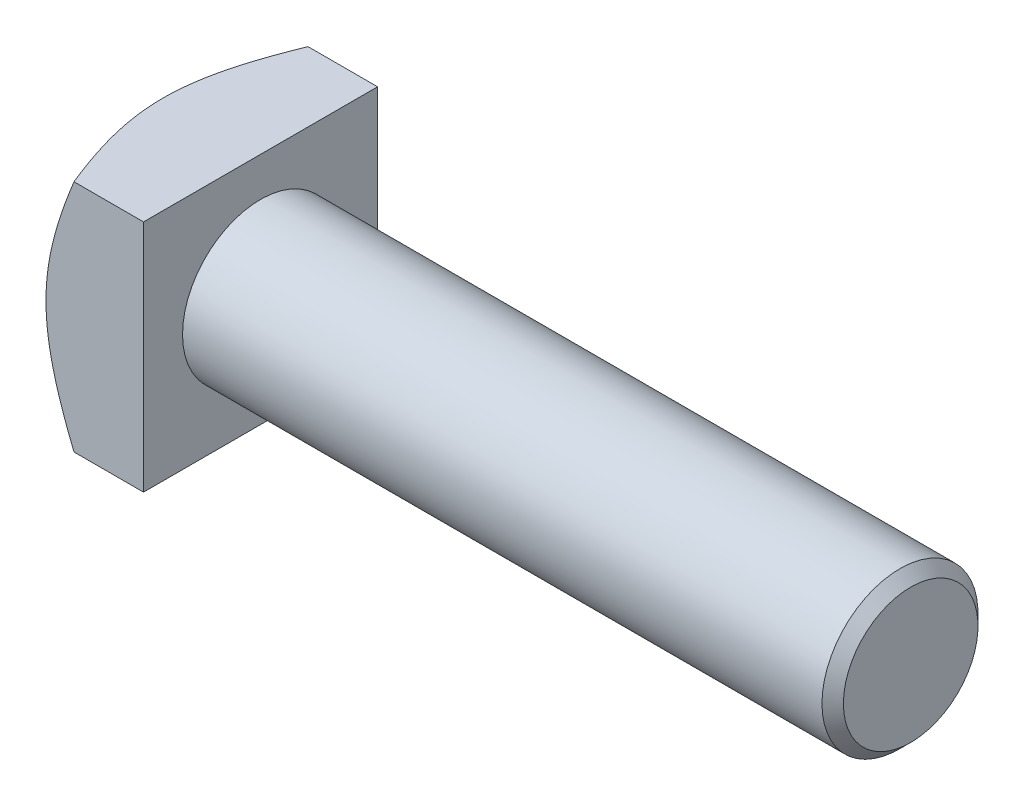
ISO-10303-21;
HEADER;
FILE_DESCRIPTION(('STEP AP214'),'2;1');
FILE_NAME('part.step','',(''),(''),'','','');
FILE_SCHEMA(('AUTOMOTIVE_DESIGN { 1 0 10303 214 1 1 1 1 }'));
ENDSEC;
DATA;
#1=APPLICATION_CONTEXT('core data for automotive mechanical design processes');
#2=APPLICATION_PROTOCOL_DEFINITION('international standard','automotive_design',2000,#1);
#3=PRODUCT_CONTEXT('',#1,'mechanical');
#4=PRODUCT('Part','Part','',(#3));
#5=PRODUCT_RELATED_PRODUCT_CATEGORY('part','',(#4));
#6=PRODUCT_DEFINITION_FORMATION('','',#4);
#7=PRODUCT_DEFINITION_CONTEXT('part definition',#1,'design');
#8=PRODUCT_DEFINITION('design','',#6,#7);
#9=PRODUCT_DEFINITION_SHAPE('','',#8);
#10=(LENGTH_UNIT() NAMED_UNIT(*) SI_UNIT(.MILLI.,.METRE.));
#11=(NAMED_UNIT(*) PLANE_ANGLE_UNIT() SI_UNIT($,.RADIAN.));
#12=(NAMED_UNIT(*) SI_UNIT($,.STERADIAN.) SOLID_ANGLE_UNIT());
#13=UNCERTAINTY_MEASURE_WITH_UNIT(LENGTH_MEASURE(1.E-05),#10,'distance_accuracy_value','');
#14=(GEOMETRIC_REPRESENTATION_CONTEXT(3) GLOBAL_UNCERTAINTY_ASSIGNED_CONTEXT((#13)) GLOBAL_UNIT_ASSIGNED_CONTEXT((#10,
#11,#12)) REPRESENTATION_CONTEXT('',''));
#15=CARTESIAN_POINT('',(0.,0.,0.));
#16=DIRECTION('',(0.,0.,1.));
#17=DIRECTION('',(1.,0.,0.));
#18=AXIS2_PLACEMENT_3D('',#15,#16,#17);
#19=CARTESIAN_POINT('',(15.,18.,18.));
#20=DIRECTION('',(0.,-1.,0.));
#21=DIRECTION('',(0.,0.,-1.));
#22=AXIS2_PLACEMENT_3D('',#19,#20,#21);
#23=PLANE('',#22);
#24=CARTESIAN_POINT('',(12.6143495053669,18.,-35.5516305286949));
#25=CARTESIAN_POINT('',(12.3897251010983,18.,-35.115539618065));
#26=CARTESIAN_POINT('',(12.1657628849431,18.,-34.6791077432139));
#27=CARTESIAN_POINT('',(11.7193055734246,18.,-33.8054922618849));
#28=CARTESIAN_POINT('',(11.4968104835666,18.,-33.3683086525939));
#29=CARTESIAN_POINT('',(10.8317168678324,18.,-32.0554797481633));
#30=CARTESIAN_POINT('',(10.3915360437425,18.,-31.1786068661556));
#31=CARTESIAN_POINT('',(9.51805366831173,18.,-29.418865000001));
#32=CARTESIAN_POINT('',(9.08477073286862,18.,-28.5359867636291));
#33=CARTESIAN_POINT('',(8.22808345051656,18.,-26.7654622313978));
#34=CARTESIAN_POINT('',(7.80467890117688,18.,-25.8778160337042));
#35=CARTESIAN_POINT('',(6.94713470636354,18.,-24.047257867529));
#36=CARTESIAN_POINT('',(6.51370370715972,18.,-23.1040131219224));
#37=CARTESIAN_POINT('',(5.66469197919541,18.,-21.2094066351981));
#38=CARTESIAN_POINT('',(5.24911226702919,18.,-20.2580444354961));
#39=CARTESIAN_POINT('',(4.64359961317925,18.,-18.8239444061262));
#40=CARTESIAN_POINT('',(4.44481871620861,18.,-18.3449395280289));
#41=CARTESIAN_POINT('',(4.05406467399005,18.,-17.3841648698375));
#42=CARTESIAN_POINT('',(3.86209139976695,18.,-16.9023951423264));
#43=CARTESIAN_POINT('',(3.48601609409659,18.,-15.9358345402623));
#44=CARTESIAN_POINT('',(3.3019133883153,18.,-15.4510439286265));
#45=CARTESIAN_POINT('',(2.942809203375,18.,-14.4781126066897));
#46=CARTESIAN_POINT('',(2.76780742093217,18.,-13.9899720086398));
#47=CARTESIAN_POINT('',(2.43022293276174,18.,-13.0154491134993));
#48=CARTESIAN_POINT('',(2.26752424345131,18.,-12.5291071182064));
#49=CARTESIAN_POINT('',(1.95406621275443,18.,-11.5526315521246));
#50=CARTESIAN_POINT('',(1.80330563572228,18.,-11.0624983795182));
#51=CARTESIAN_POINT('',(1.51554251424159,18.,-10.0782215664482));
#52=CARTESIAN_POINT('',(1.37853919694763,18.,-9.58407815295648));
#53=CARTESIAN_POINT('',(1.12025875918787,18.,-8.59148827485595));
#54=CARTESIAN_POINT('',(0.998987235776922,18.,-8.0930403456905));
#55=CARTESIAN_POINT('',(0.776567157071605,18.,-7.10179734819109));
#56=CARTESIAN_POINT('',(0.675074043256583,18.,-6.60908004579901));
#57=CARTESIAN_POINT('',(0.491413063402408,18.,-5.62006349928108));
#58=CARTESIAN_POINT('',(0.409243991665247,18.,-5.12376448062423));
#59=CARTESIAN_POINT('',(0.266179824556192,18.,-4.12821447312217));
#60=CARTESIAN_POINT('',(0.20527920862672,18.,-3.62896428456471));
#61=CARTESIAN_POINT('',(0.106341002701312,18.,-2.6282514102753));
#62=CARTESIAN_POINT('',(0.0683007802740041,18.,-2.12678898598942));
#63=CARTESIAN_POINT('',(0.0107702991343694,18.,-1.01808181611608));
#64=CARTESIAN_POINT('',(-0.00321223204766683,18.,-0.410540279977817));
#65=CARTESIAN_POINT('',(0.00445510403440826,18.,0.80424101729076));
#66=CARTESIAN_POINT('',(0.0261013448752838,18.,1.41148080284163));
#67=CARTESIAN_POINT('',(0.104069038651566,18.,2.62387258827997));
#68=CARTESIAN_POINT('',(0.160400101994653,18.,3.22902396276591));
#69=CARTESIAN_POINT('',(0.305431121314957,18.,4.43542103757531));
#70=CARTESIAN_POINT('',(0.394132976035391,18.,5.03666650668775));
#71=CARTESIAN_POINT('',(0.603510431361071,18.,6.25049011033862));
#72=CARTESIAN_POINT('',(0.724995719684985,18.,6.86292720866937));
#73=CARTESIAN_POINT('',(0.994802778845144,18.,8.08180978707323));
#74=CARTESIAN_POINT('',(1.14312501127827,18.,8.68825516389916));
#75=CARTESIAN_POINT('',(1.46277628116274,18.,9.89528627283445));
#76=CARTESIAN_POINT('',(1.63411490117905,18.,10.4958694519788));
#77=CARTESIAN_POINT('',(1.90565295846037,18.,11.3922751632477));
#78=CARTESIAN_POINT('',(1.99858593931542,18.,11.690328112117));
#79=CARTESIAN_POINT('',(2.18890137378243,18.,12.2850110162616));
#80=CARTESIAN_POINT('',(2.28628382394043,18.,12.5816409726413));
#81=CARTESIAN_POINT('',(2.57152114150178,18.,13.4307441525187));
#82=CARTESIAN_POINT('',(2.76444936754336,18.,13.9815162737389));
#83=CARTESIAN_POINT('',(3.16234165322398,18.,15.0787105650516));
#84=CARTESIAN_POINT('',(3.36730646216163,18.,15.6251324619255));
#85=CARTESIAN_POINT('',(3.78748333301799,18.,16.7141645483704));
#86=CARTESIAN_POINT('',(4.00269785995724,18.,17.2567737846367));
#87=CARTESIAN_POINT('',(4.4417893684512,18.,18.338455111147));
#88=CARTESIAN_POINT('',(4.66566618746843,18.,18.8775272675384));
#89=CARTESIAN_POINT('',(5.12102903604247,18.,19.9530541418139));
#90=CARTESIAN_POINT('',(5.35252218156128,18.,20.4895058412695));
#91=CARTESIAN_POINT('',(5.82184966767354,18.,21.5596261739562));
#92=CARTESIAN_POINT('',(6.05968403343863,18.,22.0932947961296));
#93=CARTESIAN_POINT('',(6.54077638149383,18.,23.1580998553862));
#94=CARTESIAN_POINT('',(6.78403369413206,18.,23.6892365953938));
#95=CARTESIAN_POINT('',(7.27526701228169,18.,24.749325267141));
#96=CARTESIAN_POINT('',(7.52324305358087,18.,25.2782771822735));
#97=CARTESIAN_POINT('',(8.27496653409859,18.,26.8657685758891));
#98=CARTESIAN_POINT('',(8.78489090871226,18.,27.9213844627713));
#99=CARTESIAN_POINT('',(9.81727493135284,18.,30.026473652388));
#100=CARTESIAN_POINT('',(10.3397348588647,18.,31.0759468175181));
#101=CARTESIAN_POINT('',(11.3941345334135,18.,33.1693891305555));
#102=CARTESIAN_POINT('',(11.9260689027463,18.,34.2133609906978));
#103=CARTESIAN_POINT('',(12.9976573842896,18.,36.2973185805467));
#104=CARTESIAN_POINT('',(13.537311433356,18.,37.3373043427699));
#105=CARTESIAN_POINT('',(14.5497453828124,18.,39.2742023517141));
#106=CARTESIAN_POINT('',(15.0217450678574,18.,40.1715228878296));
#107=CARTESIAN_POINT('',(15.9696412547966,18.,41.9641045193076));
#108=CARTESIAN_POINT('',(16.4455377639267,18.,42.8593656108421));
#109=CARTESIAN_POINT('',(17.4006926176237,18.,44.6482686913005));
#110=CARTESIAN_POINT('',(17.8799514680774,18.,45.5419104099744));
#111=CARTESIAN_POINT('',(18.8412702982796,18.,47.3276860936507));
#112=CARTESIAN_POINT('',(19.3233302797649,18.,48.2198200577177));
#113=CARTESIAN_POINT('',(20.2865567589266,18.,49.9967045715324));
#114=CARTESIAN_POINT('',(20.767706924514,18.,50.8814639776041));
#115=CARTESIAN_POINT('',(21.7320575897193,18.,52.6498648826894));
#116=CARTESIAN_POINT('',(22.2152580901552,18.,53.5335063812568));
#117=CARTESIAN_POINT('',(23.1833545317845,18.,55.2996537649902));
#118=CARTESIAN_POINT('',(23.6682501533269,18.,56.1821598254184));
#119=CARTESIAN_POINT('',(24.6396074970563,18.,57.9463078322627));
#120=CARTESIAN_POINT('',(25.126069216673,18.,58.8279497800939));
#121=CARTESIAN_POINT('',(25.6132070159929,18.,59.7092174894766));
#122=B_SPLINE_CURVE_WITH_KNOTS('',3,(#24,#25,#26,#27,#28,#29,#30,#31,#32,#33,#34,#35,#36,#37,
#38,#39,#40,#41,#42,#43,#44,#45,#46,#47,#48,#49,#50,#51,#52,#53,#54,#55,#56,#57,#58,#59,#60,#61,
#62,#63,#64,#65,#66,#67,#68,#69,#70,#71,#72,#73,#74,#75,#76,#77,#78,#79,#80,#81,#82,#83,#84,#85,
#86,#87,#88,#89,#90,#91,#92,#93,#94,#95,#96,#97,#98,#99,#100,#101,#102,#103,#104,#105,#106,#107,
#108,#109,#110,#111,#112,#113,#114,#115,#116,#117,#118,#119,#120,#121),.UNSPECIFIED.,.F.,.F.,(4,
2,2,2,2,2,2,2,2,2,2,2,2,2,2,2,2,2,2,2,2,2,2,2,2,2,2,2,2,2,2,2,2,2,2,2,2,2,2,2,2,2,2,2,2,2,2,2,
4),(0.,1.47162477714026,2.94325507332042,5.8866861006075,8.83704034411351,11.7873340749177,
14.9013896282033,18.0156222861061,19.5714198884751,21.1271879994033,22.6828225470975,
24.2384052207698,25.7767766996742,27.3149887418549,28.8531143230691,30.3917856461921,
31.9006252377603,33.4093706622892,34.9177241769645,36.425903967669,38.247941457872,
40.0697935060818,41.8921505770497,43.7146145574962,45.5870275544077,47.4594727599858,
49.3326999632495,50.2692875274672,51.2058743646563,52.9564472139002,54.7071291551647,
56.4582342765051,58.2093065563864,59.9620641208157,61.714828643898,63.4673779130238,
65.2199404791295,68.7367939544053,72.2537259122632,75.7687215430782,79.2836884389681,
82.3253401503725,85.3669975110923,88.4091227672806,91.4512499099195,94.4726276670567,
97.4940066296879,100.514843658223,103.535675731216),.UNSPECIFIED.);
#123=CARTESIAN_POINT('',(4.30463361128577,18.,18.));
#124=VERTEX_POINT('',#123);
#125=CARTESIAN_POINT('',(0.,18.,0.));
#126=VERTEX_POINT('',#125);
#127=EDGE_CURVE('E88',#124,#126,#122,.F.);
#128=ORIENTED_EDGE('',*,*,#127,.F.);
#129=DIRECTION('',(-1.,0.,0.));
#130=VECTOR('',#129,1.);
#131=CARTESIAN_POINT('',(15.,18.,18.));
#132=LINE('',#131,#130);
#133=CARTESIAN_POINT('',(15.,18.,18.));
#134=VERTEX_POINT('',#133);
#135=EDGE_CURVE('E174',#134,#124,#132,.T.);
#136=ORIENTED_EDGE('',*,*,#135,.F.);
#137=DIRECTION('',(0.,0.,1.));
#138=VECTOR('',#137,1.);
#139=CARTESIAN_POINT('',(15.,18.,18.));
#140=LINE('',#139,#138);
#141=CARTESIAN_POINT('',(15.,18.,-18.));
#142=VERTEX_POINT('',#141);
#143=EDGE_CURVE('E187',#142,#134,#140,.T.);
#144=ORIENTED_EDGE('',*,*,#143,.F.);
#145=DIRECTION('',(-1.,0.,0.));
#146=VECTOR('',#145,1.);
#147=CARTESIAN_POINT('',(15.,18.,-18.));
#148=LINE('',#147,#146);
#149=CARTESIAN_POINT('',(4.30463361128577,18.,-18.));
#150=VERTEX_POINT('',#149);
#151=EDGE_CURVE('E113',#142,#150,#148,.T.);
#152=ORIENTED_EDGE('',*,*,#151,.T.);
#153=EDGE_CURVE('E97',#126,#150,#122,.F.);
#154=ORIENTED_EDGE('',*,*,#153,.F.);
#155=EDGE_LOOP('',(#128,#136,#144,#152,#154));
#156=FACE_BOUND('',#155,.T.);
#157=ADVANCED_FACE('F37',(#156),#23,.F.);
#158=CARTESIAN_POINT('',(15.,18.,18.));
#159=DIRECTION('',(0.,0.,-1.));
#160=DIRECTION('',(0.,1.,0.));
#161=AXIS2_PLACEMENT_3D('',#158,#159,#160);
#162=PLANE('',#161);
#163=CARTESIAN_POINT('',(12.6143495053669,-35.5516305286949,18.));
#164=CARTESIAN_POINT('',(12.3897251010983,-35.115539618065,18.));
#165=CARTESIAN_POINT('',(12.1657628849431,-34.6791077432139,18.));
#166=CARTESIAN_POINT('',(11.7193055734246,-33.8054922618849,18.));
#167=CARTESIAN_POINT('',(11.4968104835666,-33.3683086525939,18.));
#168=CARTESIAN_POINT('',(10.8317168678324,-32.0554797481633,18.));
#169=CARTESIAN_POINT('',(10.3915360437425,-31.1786068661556,18.));
#170=CARTESIAN_POINT('',(9.51805366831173,-29.4188650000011,18.));
#171=CARTESIAN_POINT('',(9.08477073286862,-28.5359867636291,18.));
#172=CARTESIAN_POINT('',(8.22808345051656,-26.7654622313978,18.));
#173=CARTESIAN_POINT('',(7.80467890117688,-25.8778160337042,18.));
#174=CARTESIAN_POINT('',(6.94713470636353,-24.047257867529,18.));
#175=CARTESIAN_POINT('',(6.51370370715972,-23.1040131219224,18.));
#176=CARTESIAN_POINT('',(5.66469197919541,-21.2094066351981,18.));
#177=CARTESIAN_POINT('',(5.24911226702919,-20.2580444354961,18.));
#178=CARTESIAN_POINT('',(4.64359961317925,-18.8239444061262,18.));
#179=CARTESIAN_POINT('',(4.44481871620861,-18.3449395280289,18.));
#180=CARTESIAN_POINT('',(4.05406467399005,-17.3841648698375,18.));
#181=CARTESIAN_POINT('',(3.86209139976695,-16.9023951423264,18.));
#182=CARTESIAN_POINT('',(3.48601609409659,-15.9358345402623,18.));
#183=CARTESIAN_POINT('',(3.3019133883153,-15.4510439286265,18.));
#184=CARTESIAN_POINT('',(2.942809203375,-14.4781126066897,18.));
#185=CARTESIAN_POINT('',(2.76780742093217,-13.9899720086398,18.));
#186=CARTESIAN_POINT('',(2.43022293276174,-13.0154491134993,18.));
#187=CARTESIAN_POINT('',(2.26752424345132,-12.5291071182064,18.));
#188=CARTESIAN_POINT('',(1.95406621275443,-11.5526315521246,18.));
#189=CARTESIAN_POINT('',(1.80330563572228,-11.0624983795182,18.));
#190=CARTESIAN_POINT('',(1.51554251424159,-10.0782215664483,18.));
#191=CARTESIAN_POINT('',(1.37853919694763,-9.58407815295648,18.));
#192=CARTESIAN_POINT('',(1.12025875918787,-8.59148827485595,18.));
#193=CARTESIAN_POINT('',(0.998987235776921,-8.0930403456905,18.));
#194=CARTESIAN_POINT('',(0.776567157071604,-7.10179734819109,18.));
#195=CARTESIAN_POINT('',(0.675074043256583,-6.60908004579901,18.));
#196=CARTESIAN_POINT('',(0.491413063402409,-5.62006349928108,18.));
#197=CARTESIAN_POINT('',(0.409243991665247,-5.12376448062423,18.));
#198=CARTESIAN_POINT('',(0.266179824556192,-4.12821447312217,18.));
#199=CARTESIAN_POINT('',(0.20527920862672,-3.62896428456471,18.));
#200=CARTESIAN_POINT('',(0.106341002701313,-2.6282514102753,18.));
#201=CARTESIAN_POINT('',(0.068300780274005,-2.12678898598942,18.));
#202=CARTESIAN_POINT('',(0.0107702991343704,-1.01808181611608,18.));
#203=CARTESIAN_POINT('',(-0.00321223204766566,-0.410540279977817,18.));
#204=CARTESIAN_POINT('',(0.00445510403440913,0.804241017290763,18.));
#205=CARTESIAN_POINT('',(0.0261013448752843,1.41148080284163,18.));
#206=CARTESIAN_POINT('',(0.104069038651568,2.62387258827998,18.));
#207=CARTESIAN_POINT('',(0.160400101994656,3.22902396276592,18.));
#208=CARTESIAN_POINT('',(0.30543112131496,4.43542103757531,18.));
#209=CARTESIAN_POINT('',(0.394132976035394,5.03666650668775,18.));
#210=CARTESIAN_POINT('',(0.603510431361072,6.25049011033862,18.));
#211=CARTESIAN_POINT('',(0.724995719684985,6.86292720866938,18.));
#212=CARTESIAN_POINT('',(0.994802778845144,8.08180978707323,18.));
#213=CARTESIAN_POINT('',(1.14312501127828,8.68825516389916,18.));
#214=CARTESIAN_POINT('',(1.46277628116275,9.89528627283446,18.));
#215=CARTESIAN_POINT('',(1.63411490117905,10.4958694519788,18.));
#216=CARTESIAN_POINT('',(1.90565295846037,11.3922751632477,18.));
#217=CARTESIAN_POINT('',(1.99858593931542,11.690328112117,18.));
#218=CARTESIAN_POINT('',(2.18890137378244,12.2850110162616,18.));
#219=CARTESIAN_POINT('',(2.28628382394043,12.5816409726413,18.));
#220=CARTESIAN_POINT('',(2.57152114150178,13.4307441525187,18.));
#221=CARTESIAN_POINT('',(2.76444936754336,13.9815162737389,18.));
#222=CARTESIAN_POINT('',(3.16234165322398,15.0787105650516,18.));
#223=CARTESIAN_POINT('',(3.36730646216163,15.6251324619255,18.));
#224=CARTESIAN_POINT('',(3.78748333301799,16.7141645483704,18.));
#225=CARTESIAN_POINT('',(4.00269785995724,17.2567737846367,18.));
#226=CARTESIAN_POINT('',(4.4417893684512,18.338455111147,18.));
#227=CARTESIAN_POINT('',(4.66566618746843,18.8775272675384,18.));
#228=CARTESIAN_POINT('',(5.12102903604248,19.9530541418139,18.));
#229=CARTESIAN_POINT('',(5.35252218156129,20.4895058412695,18.));
#230=CARTESIAN_POINT('',(5.82184966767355,21.5596261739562,18.));
#231=CARTESIAN_POINT('',(6.05968403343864,22.0932947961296,18.));
#232=CARTESIAN_POINT('',(6.54077638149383,23.1580998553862,18.));
#233=CARTESIAN_POINT('',(6.78403369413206,23.6892365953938,18.));
#234=CARTESIAN_POINT('',(7.2752670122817,24.749325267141,18.));
#235=CARTESIAN_POINT('',(7.52324305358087,25.2782771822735,18.));
#236=CARTESIAN_POINT('',(8.2749665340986,26.8657685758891,18.));
#237=CARTESIAN_POINT('',(8.78489090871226,27.9213844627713,18.));
#238=CARTESIAN_POINT('',(9.81727493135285,30.026473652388,18.));
#239=CARTESIAN_POINT('',(10.3397348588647,31.0759468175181,18.));
#240=CARTESIAN_POINT('',(11.3941345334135,33.1693891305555,18.));
#241=CARTESIAN_POINT('',(11.9260689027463,34.2133609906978,18.));
#242=CARTESIAN_POINT('',(12.9976573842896,36.2973185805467,18.));
#243=CARTESIAN_POINT('',(13.537311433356,37.3373043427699,18.));
#244=CARTESIAN_POINT('',(14.5497453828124,39.2742023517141,18.));
#245=CARTESIAN_POINT('',(15.0217450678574,40.1715228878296,18.));
#246=CARTESIAN_POINT('',(15.9696412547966,41.9641045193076,18.));
#247=CARTESIAN_POINT('',(16.4455377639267,42.8593656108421,18.));
#248=CARTESIAN_POINT('',(17.4006926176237,44.6482686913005,18.));
#249=CARTESIAN_POINT('',(17.8799514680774,45.5419104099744,18.));
#250=CARTESIAN_POINT('',(18.8412702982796,47.3276860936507,18.));
#251=CARTESIAN_POINT('',(19.3233302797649,48.2198200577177,18.));
#252=CARTESIAN_POINT('',(20.2865567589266,49.9967045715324,18.));
#253=CARTESIAN_POINT('',(20.767706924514,50.8814639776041,18.));
#254=CARTESIAN_POINT('',(21.7320575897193,52.6498648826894,18.));
#255=CARTESIAN_POINT('',(22.2152580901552,53.5335063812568,18.));
#256=CARTESIAN_POINT('',(23.1833545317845,55.2996537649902,18.));
#257=CARTESIAN_POINT('',(23.6682501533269,56.1821598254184,18.));
#258=CARTESIAN_POINT('',(24.6396074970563,57.9463078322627,18.));
#259=CARTESIAN_POINT('',(25.126069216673,58.8279497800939,18.));
#260=CARTESIAN_POINT('',(25.6132070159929,59.7092174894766,18.));
#261=B_SPLINE_CURVE_WITH_KNOTS('',3,(#163,#164,#165,#166,#167,#168,#169,#170,#171,#172,#173,
#174,#175,#176,#177,#178,#179,#180,#181,#182,#183,#184,#185,#186,#187,#188,#189,#190,#191,#192,
#193,#194,#195,#196,#197,#198,#199,#200,#201,#202,#203,#204,#205,#206,#207,#208,#209,#210,#211,
#212,#213,#214,#215,#216,#217,#218,#219,#220,#221,#222,#223,#224,#225,#226,#227,#228,#229,#230,
#231,#232,#233,#234,#235,#236,#237,#238,#239,#240,#241,#242,#243,#244,#245,#246,#247,#248,#249,
#250,#251,#252,#253,#254,#255,#256,#257,#258,#259,#260),.UNSPECIFIED.,.F.,.F.,(4,2,2,2,2,2,2,2,
2,2,2,2,2,2,2,2,2,2,2,2,2,2,2,2,2,2,2,2,2,2,2,2,2,2,2,2,2,2,2,2,2,2,2,2,2,2,2,2,4),(0.,
1.47162477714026,2.94325507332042,5.8866861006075,8.8370403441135,11.7873340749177,
14.9013896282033,18.0156222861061,19.5714198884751,21.1271879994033,22.6828225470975,
24.2384052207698,25.7767766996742,27.3149887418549,28.8531143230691,30.3917856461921,
31.9006252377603,33.4093706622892,34.9177241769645,36.425903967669,38.247941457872,
40.0697935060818,41.8921505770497,43.7146145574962,45.5870275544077,47.4594727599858,
49.3326999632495,50.2692875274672,51.2058743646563,52.9564472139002,54.7071291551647,
56.4582342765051,58.2093065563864,59.9620641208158,61.714828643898,63.4673779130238,
65.2199404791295,68.7367939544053,72.2537259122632,75.7687215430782,79.2836884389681,
82.3253401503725,85.3669975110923,88.4091227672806,91.4512499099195,94.4726276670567,
97.4940066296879,100.514843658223,103.535675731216),.UNSPECIFIED.);
#262=CARTESIAN_POINT('',(4.30463361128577,-18.,18.));
#263=VERTEX_POINT('',#262);
#264=CARTESIAN_POINT('',(0.,0.,18.));
#265=VERTEX_POINT('',#264);
#266=EDGE_CURVE('E165',#263,#265,#261,.T.);
#267=ORIENTED_EDGE('',*,*,#266,.F.);
#268=DIRECTION('',(-1.,0.,0.));
#269=VECTOR('',#268,1.);
#270=CARTESIAN_POINT('',(15.,-18.,18.));
#271=LINE('',#270,#269);
#272=CARTESIAN_POINT('',(15.,-18.,18.));
#273=VERTEX_POINT('',#272);
#274=EDGE_CURVE('E167',#273,#263,#271,.T.);
#275=ORIENTED_EDGE('',*,*,#274,.F.);
#276=DIRECTION('',(0.,-1.,0.));
#277=VECTOR('',#276,1.);
#278=CARTESIAN_POINT('',(15.,18.,18.));
#279=LINE('',#278,#277);
#280=EDGE_CURVE('E185',#134,#273,#279,.T.);
#281=ORIENTED_EDGE('',*,*,#280,.F.);
#282=ORIENTED_EDGE('',*,*,#135,.T.);
#283=EDGE_CURVE('E91',#265,#124,#261,.T.);
#284=ORIENTED_EDGE('',*,*,#283,.F.);
#285=EDGE_LOOP('',(#267,#275,#281,#282,#284));
#286=FACE_BOUND('',#285,.T.);
#287=ADVANCED_FACE('F155',(#286),#162,.F.);
#288=CARTESIAN_POINT('',(15.,-18.,18.));
#289=DIRECTION('',(0.,1.,0.));
#290=DIRECTION('',(0.,0.,1.));
#291=AXIS2_PLACEMENT_3D('',#288,#289,#290);
#292=PLANE('',#291);
#293=CARTESIAN_POINT('',(12.6143495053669,-18.,-35.5516305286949));
#294=CARTESIAN_POINT('',(12.3897251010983,-18.,-35.115539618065));
#295=CARTESIAN_POINT('',(12.1657628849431,-18.,-34.6791077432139));
#296=CARTESIAN_POINT('',(11.7193055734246,-18.,-33.8054922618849));
#297=CARTESIAN_POINT('',(11.4968104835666,-18.,-33.3683086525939));
#298=CARTESIAN_POINT('',(10.8317168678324,-18.,-32.0554797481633));
#299=CARTESIAN_POINT('',(10.3915360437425,-18.,-31.1786068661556));
#300=CARTESIAN_POINT('',(9.51805366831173,-18.,-29.418865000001));
#301=CARTESIAN_POINT('',(9.08477073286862,-18.,-28.5359867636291));
#302=CARTESIAN_POINT('',(8.22808345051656,-18.,-26.7654622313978));
#303=CARTESIAN_POINT('',(7.80467890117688,-18.,-25.8778160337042));
#304=CARTESIAN_POINT('',(6.94713470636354,-18.,-24.047257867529));
#305=CARTESIAN_POINT('',(6.51370370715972,-18.,-23.1040131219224));
#306=CARTESIAN_POINT('',(5.66469197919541,-18.,-21.2094066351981));
#307=CARTESIAN_POINT('',(5.24911226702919,-18.,-20.2580444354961));
#308=CARTESIAN_POINT('',(4.64359961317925,-18.,-18.8239444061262));
#309=CARTESIAN_POINT('',(4.44481871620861,-18.,-18.3449395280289));
#310=CARTESIAN_POINT('',(4.05406467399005,-18.,-17.3841648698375));
#311=CARTESIAN_POINT('',(3.86209139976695,-18.,-16.9023951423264));
#312=CARTESIAN_POINT('',(3.48601609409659,-18.,-15.9358345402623));
#313=CARTESIAN_POINT('',(3.3019133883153,-18.,-15.4510439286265));
#314=CARTESIAN_POINT('',(2.942809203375,-18.,-14.4781126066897));
#315=CARTESIAN_POINT('',(2.76780742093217,-18.,-13.9899720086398));
#316=CARTESIAN_POINT('',(2.43022293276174,-18.,-13.0154491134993));
#317=CARTESIAN_POINT('',(2.26752424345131,-18.,-12.5291071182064));
#318=CARTESIAN_POINT('',(1.95406621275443,-18.,-11.5526315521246));
#319=CARTESIAN_POINT('',(1.80330563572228,-18.,-11.0624983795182));
#320=CARTESIAN_POINT('',(1.51554251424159,-18.,-10.0782215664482));
#321=CARTESIAN_POINT('',(1.37853919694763,-18.,-9.58407815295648));
#322=CARTESIAN_POINT('',(1.12025875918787,-18.,-8.59148827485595));
#323=CARTESIAN_POINT('',(0.998987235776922,-18.,-8.0930403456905));
#324=CARTESIAN_POINT('',(0.776567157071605,-18.,-7.10179734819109));
#325=CARTESIAN_POINT('',(0.675074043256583,-18.,-6.60908004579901));
#326=CARTESIAN_POINT('',(0.491413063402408,-18.,-5.62006349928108));
#327=CARTESIAN_POINT('',(0.409243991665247,-18.,-5.12376448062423));
#328=CARTESIAN_POINT('',(0.266179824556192,-18.,-4.12821447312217));
#329=CARTESIAN_POINT('',(0.20527920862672,-18.,-3.62896428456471));
#330=CARTESIAN_POINT('',(0.106341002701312,-18.,-2.6282514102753));
#331=CARTESIAN_POINT('',(0.0683007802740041,-18.,-2.12678898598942));
#332=CARTESIAN_POINT('',(0.0107702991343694,-18.,-1.01808181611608));
#333=CARTESIAN_POINT('',(-0.00321223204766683,-18.,-0.410540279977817));
#334=CARTESIAN_POINT('',(0.00445510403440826,-18.,0.80424101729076));
#335=CARTESIAN_POINT('',(0.0261013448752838,-18.,1.41148080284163));
#336=CARTESIAN_POINT('',(0.104069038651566,-18.,2.62387258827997));
#337=CARTESIAN_POINT('',(0.160400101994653,-18.,3.22902396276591));
#338=CARTESIAN_POINT('',(0.305431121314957,-18.,4.43542103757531));
#339=CARTESIAN_POINT('',(0.394132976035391,-18.,5.03666650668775));
#340=CARTESIAN_POINT('',(0.603510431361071,-18.,6.25049011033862));
#341=CARTESIAN_POINT('',(0.724995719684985,-18.,6.86292720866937));
#342=CARTESIAN_POINT('',(0.994802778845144,-18.,8.08180978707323));
#343=CARTESIAN_POINT('',(1.14312501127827,-18.,8.68825516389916));
#344=CARTESIAN_POINT('',(1.46277628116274,-18.,9.89528627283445));
#345=CARTESIAN_POINT('',(1.63411490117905,-18.,10.4958694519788));
#346=CARTESIAN_POINT('',(1.90565295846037,-18.,11.3922751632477));
#347=CARTESIAN_POINT('',(1.99858593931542,-18.,11.690328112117));
#348=CARTESIAN_POINT('',(2.18890137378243,-18.,12.2850110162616));
#349=CARTESIAN_POINT('',(2.28628382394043,-18.,12.5816409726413));
#350=CARTESIAN_POINT('',(2.57152114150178,-18.,13.4307441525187));
#351=CARTESIAN_POINT('',(2.76444936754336,-18.,13.9815162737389));
#352=CARTESIAN_POINT('',(3.16234165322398,-18.,15.0787105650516));
#353=CARTESIAN_POINT('',(3.36730646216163,-18.,15.6251324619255));
#354=CARTESIAN_POINT('',(3.78748333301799,-18.,16.7141645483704));
#355=CARTESIAN_POINT('',(4.00269785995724,-18.,17.2567737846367));
#356=CARTESIAN_POINT('',(4.4417893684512,-18.,18.338455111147));
#357=CARTESIAN_POINT('',(4.66566618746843,-18.,18.8775272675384));
#358=CARTESIAN_POINT('',(5.12102903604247,-18.,19.9530541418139));
#359=CARTESIAN_POINT('',(5.35252218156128,-18.,20.4895058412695));
#360=CARTESIAN_POINT('',(5.82184966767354,-18.,21.5596261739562));
#361=CARTESIAN_POINT('',(6.05968403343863,-18.,22.0932947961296));
#362=CARTESIAN_POINT('',(6.54077638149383,-18.,23.1580998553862));
#363=CARTESIAN_POINT('',(6.78403369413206,-18.,23.6892365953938));
#364=CARTESIAN_POINT('',(7.27526701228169,-18.,24.749325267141));
#365=CARTESIAN_POINT('',(7.52324305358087,-18.,25.2782771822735));
#366=CARTESIAN_POINT('',(8.27496653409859,-18.,26.8657685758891));
#367=CARTESIAN_POINT('',(8.78489090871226,-18.,27.9213844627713));
#368=CARTESIAN_POINT('',(9.81727493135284,-18.,30.026473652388));
#369=CARTESIAN_POINT('',(10.3397348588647,-18.,31.0759468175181));
#370=CARTESIAN_POINT('',(11.3941345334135,-18.,33.1693891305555));
#371=CARTESIAN_POINT('',(11.9260689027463,-18.,34.2133609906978));
#372=CARTESIAN_POINT('',(12.9976573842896,-18.,36.2973185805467));
#373=CARTESIAN_POINT('',(13.537311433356,-18.,37.3373043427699));
#374=CARTESIAN_POINT('',(14.5497453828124,-18.,39.2742023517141));
#375=CARTESIAN_POINT('',(15.0217450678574,-18.,40.1715228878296));
#376=CARTESIAN_POINT('',(15.9696412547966,-18.,41.9641045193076));
#377=CARTESIAN_POINT('',(16.4455377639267,-18.,42.8593656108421));
#378=CARTESIAN_POINT('',(17.4006926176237,-18.,44.6482686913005));
#379=CARTESIAN_POINT('',(17.8799514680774,-18.,45.5419104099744));
#380=CARTESIAN_POINT('',(18.8412702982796,-18.,47.3276860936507));
#381=CARTESIAN_POINT('',(19.3233302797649,-18.,48.2198200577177));
#382=CARTESIAN_POINT('',(20.2865567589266,-18.,49.9967045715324));
#383=CARTESIAN_POINT('',(20.767706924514,-18.,50.8814639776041));
#384=CARTESIAN_POINT('',(21.7320575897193,-18.,52.6498648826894));
#385=CARTESIAN_POINT('',(22.2152580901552,-18.,53.5335063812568));
#386=CARTESIAN_POINT('',(23.1833545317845,-18.,55.2996537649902));
#387=CARTESIAN_POINT('',(23.6682501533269,-18.,56.1821598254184));
#388=CARTESIAN_POINT('',(24.6396074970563,-18.,57.9463078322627));
#389=CARTESIAN_POINT('',(25.126069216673,-18.,58.8279497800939));
#390=CARTESIAN_POINT('',(25.6132070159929,-18.,59.7092174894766));
#391=B_SPLINE_CURVE_WITH_KNOTS('',3,(#293,#294,#295,#296,#297,#298,#299,#300,#301,#302,#303,
#304,#305,#306,#307,#308,#309,#310,#311,#312,#313,#314,#315,#316,#317,#318,#319,#320,#321,#322,
#323,#324,#325,#326,#327,#328,#329,#330,#331,#332,#333,#334,#335,#336,#337,#338,#339,#340,#341,
#342,#343,#344,#345,#346,#347,#348,#349,#350,#351,#352,#353,#354,#355,#356,#357,#358,#359,#360,
#361,#362,#363,#364,#365,#366,#367,#368,#369,#370,#371,#372,#373,#374,#375,#376,#377,#378,#379,
#380,#381,#382,#383,#384,#385,#386,#387,#388,#389,#390),.UNSPECIFIED.,.F.,.F.,(4,2,2,2,2,2,2,2,
2,2,2,2,2,2,2,2,2,2,2,2,2,2,2,2,2,2,2,2,2,2,2,2,2,2,2,2,2,2,2,2,2,2,2,2,2,2,2,2,4),(0.,
1.47162477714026,2.94325507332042,5.8866861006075,8.83704034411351,11.7873340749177,
14.9013896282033,18.0156222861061,19.5714198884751,21.1271879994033,22.6828225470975,
24.2384052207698,25.7767766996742,27.3149887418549,28.8531143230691,30.3917856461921,
31.9006252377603,33.4093706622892,34.9177241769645,36.425903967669,38.247941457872,
40.0697935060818,41.8921505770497,43.7146145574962,45.5870275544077,47.4594727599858,
49.3326999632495,50.2692875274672,51.2058743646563,52.9564472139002,54.7071291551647,
56.4582342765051,58.2093065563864,59.9620641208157,61.714828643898,63.4673779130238,
65.2199404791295,68.7367939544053,72.2537259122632,75.7687215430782,79.2836884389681,
82.3253401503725,85.3669975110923,88.4091227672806,91.4512499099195,94.4726276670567,
97.4940066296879,100.514843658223,103.535675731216),.UNSPECIFIED.);
#392=CARTESIAN_POINT('',(4.30463361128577,-18.,-18.));
#393=VERTEX_POINT('',#392);
#394=CARTESIAN_POINT('',(0.,-18.,0.));
#395=VERTEX_POINT('',#394);
#396=EDGE_CURVE('E114',#393,#395,#391,.T.);
#397=ORIENTED_EDGE('',*,*,#396,.F.);
#398=DIRECTION('',(-1.,0.,0.));
#399=VECTOR('',#398,1.);
#400=CARTESIAN_POINT('',(15.,-18.,-18.));
#401=LINE('',#400,#399);
#402=CARTESIAN_POINT('',(15.,-18.,-18.));
#403=VERTEX_POINT('',#402);
#404=EDGE_CURVE('E175',#403,#393,#401,.T.);
#405=ORIENTED_EDGE('',*,*,#404,.F.);
#406=DIRECTION('',(0.,0.,-1.));
#407=VECTOR('',#406,1.);
#408=CARTESIAN_POINT('',(15.,-18.,18.));
#409=LINE('',#408,#407);
#410=EDGE_CURVE('E173',#273,#403,#409,.T.);
#411=ORIENTED_EDGE('',*,*,#410,.F.);
#412=ORIENTED_EDGE('',*,*,#274,.T.);
#413=EDGE_CURVE('E96',#395,#263,#391,.T.);
#414=ORIENTED_EDGE('',*,*,#413,.F.);
#415=EDGE_LOOP('',(#397,#405,#411,#412,#414));
#416=FACE_BOUND('',#415,.T.);
#417=ADVANCED_FACE('F150',(#416),#292,.F.);
#418=CARTESIAN_POINT('',(15.,18.,-18.));
#419=DIRECTION('',(0.,0.,1.));
#420=DIRECTION('',(1.,0.,0.));
#421=AXIS2_PLACEMENT_3D('',#418,#419,#420);
#422=PLANE('',#421);
#423=CARTESIAN_POINT('',(12.6143495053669,-35.5516305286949,-18.));
#424=CARTESIAN_POINT('',(12.3897251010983,-35.115539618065,-18.));
#425=CARTESIAN_POINT('',(12.1657628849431,-34.6791077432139,-18.));
#426=CARTESIAN_POINT('',(11.7193055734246,-33.8054922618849,-18.));
#427=CARTESIAN_POINT('',(11.4968104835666,-33.3683086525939,-18.));
#428=CARTESIAN_POINT('',(10.8317168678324,-32.0554797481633,-18.));
#429=CARTESIAN_POINT('',(10.3915360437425,-31.1786068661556,-18.));
#430=CARTESIAN_POINT('',(9.51805366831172,-29.418865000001,-18.));
#431=CARTESIAN_POINT('',(9.08477073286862,-28.5359867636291,-18.));
#432=CARTESIAN_POINT('',(8.22808345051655,-26.7654622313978,-18.));
#433=CARTESIAN_POINT('',(7.80467890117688,-25.8778160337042,-18.));
#434=CARTESIAN_POINT('',(6.94713470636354,-24.047257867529,-18.));
#435=CARTESIAN_POINT('',(6.51370370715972,-23.1040131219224,-18.));
#436=CARTESIAN_POINT('',(5.66469197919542,-21.2094066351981,-18.));
#437=CARTESIAN_POINT('',(5.24911226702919,-20.2580444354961,-18.));
#438=CARTESIAN_POINT('',(4.64359961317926,-18.8239444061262,-18.));
#439=CARTESIAN_POINT('',(4.44481871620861,-18.3449395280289,-18.));
#440=CARTESIAN_POINT('',(4.05406467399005,-17.3841648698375,-18.));
#441=CARTESIAN_POINT('',(3.86209139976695,-16.9023951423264,-18.));
#442=CARTESIAN_POINT('',(3.4860160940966,-15.9358345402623,-18.));
#443=CARTESIAN_POINT('',(3.30191338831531,-15.4510439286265,-18.));
#444=CARTESIAN_POINT('',(2.942809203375,-14.4781126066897,-18.));
#445=CARTESIAN_POINT('',(2.76780742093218,-13.9899720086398,-18.));
#446=CARTESIAN_POINT('',(2.43022293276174,-13.0154491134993,-18.));
#447=CARTESIAN_POINT('',(2.26752424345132,-12.5291071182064,-18.));
#448=CARTESIAN_POINT('',(1.95406621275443,-11.5526315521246,-18.));
#449=CARTESIAN_POINT('',(1.80330563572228,-11.0624983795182,-18.));
#450=CARTESIAN_POINT('',(1.51554251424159,-10.0782215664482,-18.));
#451=CARTESIAN_POINT('',(1.37853919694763,-9.58407815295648,-18.));
#452=CARTESIAN_POINT('',(1.12025875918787,-8.59148827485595,-18.));
#453=CARTESIAN_POINT('',(0.99898723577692,-8.0930403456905,-18.));
#454=CARTESIAN_POINT('',(0.776567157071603,-7.10179734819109,-18.));
#455=CARTESIAN_POINT('',(0.67507404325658,-6.60908004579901,-18.));
#456=CARTESIAN_POINT('',(0.491413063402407,-5.62006349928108,-18.));
#457=CARTESIAN_POINT('',(0.409243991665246,-5.12376448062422,-18.));
#458=CARTESIAN_POINT('',(0.266179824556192,-4.12821447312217,-18.));
#459=CARTESIAN_POINT('',(0.20527920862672,-3.62896428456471,-18.));
#460=CARTESIAN_POINT('',(0.106341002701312,-2.6282514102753,-18.));
#461=CARTESIAN_POINT('',(0.0683007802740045,-2.12678898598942,-18.));
#462=CARTESIAN_POINT('',(0.0107702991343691,-1.01808181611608,-18.));
#463=CARTESIAN_POINT('',(-0.00321223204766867,-0.410540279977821,-18.));
#464=CARTESIAN_POINT('',(0.00445510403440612,0.804241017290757,-18.));
#465=CARTESIAN_POINT('',(0.0261013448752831,1.41148080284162,-18.));
#466=CARTESIAN_POINT('',(0.104069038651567,2.62387258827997,-18.));
#467=CARTESIAN_POINT('',(0.160400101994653,3.22902396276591,-18.));
#468=CARTESIAN_POINT('',(0.305431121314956,4.43542103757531,-18.));
#469=CARTESIAN_POINT('',(0.39413297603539,5.03666650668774,-18.));
#470=CARTESIAN_POINT('',(0.603510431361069,6.25049011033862,-18.));
#471=CARTESIAN_POINT('',(0.724995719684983,6.86292720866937,-18.));
#472=CARTESIAN_POINT('',(0.994802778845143,8.08180978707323,-18.));
#473=CARTESIAN_POINT('',(1.14312501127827,8.68825516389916,-18.));
#474=CARTESIAN_POINT('',(1.46277628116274,9.89528627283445,-18.));
#475=CARTESIAN_POINT('',(1.63411490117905,10.4958694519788,-18.));
#476=CARTESIAN_POINT('',(1.90565295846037,11.3922751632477,-18.));
#477=CARTESIAN_POINT('',(1.99858593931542,11.690328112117,-18.));
#478=CARTESIAN_POINT('',(2.18890137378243,12.2850110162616,-18.));
#479=CARTESIAN_POINT('',(2.28628382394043,12.5816409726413,-18.));
#480=CARTESIAN_POINT('',(2.57152114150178,13.4307441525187,-18.));
#481=CARTESIAN_POINT('',(2.76444936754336,13.9815162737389,-18.));
#482=CARTESIAN_POINT('',(3.16234165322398,15.0787105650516,-18.));
#483=CARTESIAN_POINT('',(3.36730646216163,15.6251324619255,-18.));
#484=CARTESIAN_POINT('',(3.78748333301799,16.7141645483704,-18.));
#485=CARTESIAN_POINT('',(4.00269785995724,17.2567737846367,-18.));
#486=CARTESIAN_POINT('',(4.44178936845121,18.338455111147,-18.));
#487=CARTESIAN_POINT('',(4.66566618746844,18.8775272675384,-18.));
#488=CARTESIAN_POINT('',(5.12102903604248,19.9530541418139,-18.));
#489=CARTESIAN_POINT('',(5.35252218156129,20.4895058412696,-18.));
#490=CARTESIAN_POINT('',(5.82184966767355,21.5596261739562,-18.));
#491=CARTESIAN_POINT('',(6.05968403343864,22.0932947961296,-18.));
#492=CARTESIAN_POINT('',(6.54077638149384,23.1580998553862,-18.));
#493=CARTESIAN_POINT('',(6.78403369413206,23.6892365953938,-18.));
#494=CARTESIAN_POINT('',(7.2752670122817,24.749325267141,-18.));
#495=CARTESIAN_POINT('',(7.52324305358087,25.2782771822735,-18.));
#496=CARTESIAN_POINT('',(8.2749665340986,26.8657685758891,-18.));
#497=CARTESIAN_POINT('',(8.78489090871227,27.9213844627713,-18.));
#498=CARTESIAN_POINT('',(9.81727493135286,30.026473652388,-18.));
#499=CARTESIAN_POINT('',(10.3397348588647,31.0759468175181,-18.));
#500=CARTESIAN_POINT('',(11.3941345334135,33.1693891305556,-18.));
#501=CARTESIAN_POINT('',(11.9260689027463,34.2133609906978,-18.));
#502=CARTESIAN_POINT('',(12.9976573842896,36.2973185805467,-18.));
#503=CARTESIAN_POINT('',(13.537311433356,37.3373043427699,-18.));
#504=CARTESIAN_POINT('',(14.5497453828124,39.2742023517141,-18.));
#505=CARTESIAN_POINT('',(15.0217450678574,40.1715228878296,-18.));
#506=CARTESIAN_POINT('',(15.9696412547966,41.9641045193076,-18.));
#507=CARTESIAN_POINT('',(16.4455377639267,42.8593656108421,-18.));
#508=CARTESIAN_POINT('',(17.4006926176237,44.6482686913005,-18.));
#509=CARTESIAN_POINT('',(17.8799514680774,45.5419104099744,-18.));
#510=CARTESIAN_POINT('',(18.8412702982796,47.3276860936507,-18.));
#511=CARTESIAN_POINT('',(19.3233302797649,48.2198200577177,-18.));
#512=CARTESIAN_POINT('',(20.2865567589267,49.9967045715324,-18.));
#513=CARTESIAN_POINT('',(20.767706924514,50.8814639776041,-18.));
#514=CARTESIAN_POINT('',(21.7320575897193,52.6498648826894,-18.));
#515=CARTESIAN_POINT('',(22.2152580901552,53.5335063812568,-18.));
#516=CARTESIAN_POINT('',(23.1833545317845,55.2996537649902,-18.));
#517=CARTESIAN_POINT('',(23.6682501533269,56.1821598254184,-18.));
#518=CARTESIAN_POINT('',(24.6396074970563,57.9463078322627,-18.));
#519=CARTESIAN_POINT('',(25.126069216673,58.8279497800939,-18.));
#520=CARTESIAN_POINT('',(25.6132070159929,59.7092174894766,-18.));
#521=B_SPLINE_CURVE_WITH_KNOTS('',3,(#423,#424,#425,#426,#427,#428,#429,#430,#431,#432,#433,
#434,#435,#436,#437,#438,#439,#440,#441,#442,#443,#444,#445,#446,#447,#448,#449,#450,#451,#452,
#453,#454,#455,#456,#457,#458,#459,#460,#461,#462,#463,#464,#465,#466,#467,#468,#469,#470,#471,
#472,#473,#474,#475,#476,#477,#478,#479,#480,#481,#482,#483,#484,#485,#486,#487,#488,#489,#490,
#491,#492,#493,#494,#495,#496,#497,#498,#499,#500,#501,#502,#503,#504,#505,#506,#507,#508,#509,
#510,#511,#512,#513,#514,#515,#516,#517,#518,#519,#520),.UNSPECIFIED.,.F.,.F.,(4,2,2,2,2,2,2,2,
2,2,2,2,2,2,2,2,2,2,2,2,2,2,2,2,2,2,2,2,2,2,2,2,2,2,2,2,2,2,2,2,2,2,2,2,2,2,2,2,4),(0.,
1.47162477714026,2.94325507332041,5.8866861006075,8.83704034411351,11.7873340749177,
14.9013896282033,18.0156222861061,19.5714198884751,21.1271879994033,22.6828225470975,
24.2384052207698,25.7767766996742,27.3149887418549,28.8531143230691,30.3917856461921,
31.9006252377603,33.4093706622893,34.9177241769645,36.425903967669,38.247941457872,
40.0697935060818,41.8921505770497,43.7146145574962,45.5870275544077,47.4594727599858,
49.3326999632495,50.2692875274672,51.2058743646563,52.9564472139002,54.7071291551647,
56.4582342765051,58.2093065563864,59.9620641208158,61.7148286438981,63.4673779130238,
65.2199404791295,68.7367939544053,72.2537259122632,75.7687215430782,79.2836884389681,
82.3253401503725,85.3669975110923,88.4091227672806,91.4512499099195,94.4726276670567,
97.4940066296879,100.514843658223,103.535675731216),.UNSPECIFIED.);
#522=CARTESIAN_POINT('',(0.,0.,-18.));
#523=VERTEX_POINT('',#522);
#524=EDGE_CURVE('E103',#150,#523,#521,.F.);
#525=ORIENTED_EDGE('',*,*,#524,.F.);
#526=ORIENTED_EDGE('',*,*,#151,.F.);
#527=DIRECTION('',(0.,1.,0.));
#528=VECTOR('',#527,1.);
#529=CARTESIAN_POINT('',(15.,18.,-18.));
#530=LINE('',#529,#528);
#531=EDGE_CURVE('E182',#403,#142,#530,.T.);
#532=ORIENTED_EDGE('',*,*,#531,.F.);
#533=ORIENTED_EDGE('',*,*,#404,.T.);
#534=EDGE_CURVE('E108',#523,#393,#521,.F.);
#535=ORIENTED_EDGE('',*,*,#534,.F.);
#536=EDGE_LOOP('',(#525,#526,#532,#533,#535));
#537=FACE_BOUND('',#536,.T.);
#538=ADVANCED_FACE('F145',(#537),#422,.F.);
#539=CARTESIAN_POINT('',(15.,18.,-18.));
#540=DIRECTION('',(-1.,0.,0.));
#541=DIRECTION('',(0.,0.,1.));
#542=AXIS2_PLACEMENT_3D('',#539,#540,#541);
#543=PLANE('',#542);
#544=ORIENTED_EDGE('',*,*,#143,.T.);
#545=ORIENTED_EDGE('',*,*,#280,.T.);
#546=ORIENTED_EDGE('',*,*,#410,.T.);
#547=ORIENTED_EDGE('',*,*,#531,.T.);
#548=EDGE_LOOP('',(#544,#545,#546,#547));
#549=FACE_BOUND('',#548,.T.);
#550=CARTESIAN_POINT('',(15.,0.,0.));
#551=DIRECTION('',(-1.,0.,0.));
#552=DIRECTION('',(0.,0.,1.));
#553=AXIS2_PLACEMENT_3D('',#550,#551,#552);
#554=CIRCLE('',#553,12.);
#555=CARTESIAN_POINT('',(15.,0.,12.));
#556=VERTEX_POINT('',#555);
#557=EDGE_CURVE('E177',#556,#556,#554,.F.);
#558=ORIENTED_EDGE('',*,*,#557,.F.);
#559=EDGE_LOOP('',(#558));
#560=FACE_BOUND('',#559,.T.);
#561=ADVANCED_FACE('F149',(#549,#560),#543,.F.);
#562=CARTESIAN_POINT('',(0.,0.,0.));
#563=DIRECTION('',(-1.,0.,0.));
#564=DIRECTION('',(0.,0.,1.));
#565=AXIS2_PLACEMENT_3D('',#562,#563,#564);
#566=CYLINDRICAL_SURFACE('',#565,12.);
#567=CARTESIAN_POINT('',(113.352,0.,0.));
#568=DIRECTION('',(-1.,0.,0.));
#569=DIRECTION('',(0.,0.,1.));
#570=AXIS2_PLACEMENT_3D('',#567,#568,#569);
#571=CIRCLE('',#570,12.);
#572=CARTESIAN_POINT('',(113.352,0.,12.));
#573=VERTEX_POINT('',#572);
#574=EDGE_CURVE('E190',#573,#573,#571,.T.);
#575=ORIENTED_EDGE('',*,*,#574,.T.);
#576=EDGE_LOOP('',(#575));
#577=FACE_BOUND('',#576,.T.);
#578=ORIENTED_EDGE('',*,*,#557,.T.);
#579=EDGE_LOOP('',(#578));
#580=FACE_BOUND('',#579,.T.);
#581=ADVANCED_FACE('F203',(#577,#580),#566,.T.);
#582=CARTESIAN_POINT('',(115.,0.,0.));
#583=DIRECTION('',(-1.,0.,0.));
#584=DIRECTION('',(0.,0.,1.));
#585=AXIS2_PLACEMENT_3D('',#582,#583,#584);
#586=CONICAL_SURFACE('',#585,10.352,0.785398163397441);
#587=ORIENTED_EDGE('',*,*,#574,.F.);
#588=EDGE_LOOP('',(#587));
#589=FACE_BOUND('',#588,.T.);
#590=CARTESIAN_POINT('',(115.,0.,0.));
#591=DIRECTION('',(-1.,0.,0.));
#592=DIRECTION('',(0.,0.,1.));
#593=AXIS2_PLACEMENT_3D('',#590,#591,#592);
#594=CIRCLE('',#593,10.352);
#595=CARTESIAN_POINT('',(115.,0.,10.352));
#596=VERTEX_POINT('',#595);
#597=EDGE_CURVE('E169',#596,#596,#594,.T.);
#598=ORIENTED_EDGE('',*,*,#597,.T.);
#599=EDGE_LOOP('',(#598));
#600=FACE_BOUND('',#599,.T.);
#601=ADVANCED_FACE('F197',(#589,#600),#586,.T.);
#602=CARTESIAN_POINT('',(115.,0.,0.));
#603=DIRECTION('',(-1.,0.,0.));
#604=DIRECTION('',(0.,0.,1.));
#605=AXIS2_PLACEMENT_3D('',#602,#603,#604);
#606=PLANE('',#605);
#607=ORIENTED_EDGE('',*,*,#597,.F.);
#608=EDGE_LOOP('',(#607));
#609=FACE_BOUND('',#608,.T.);
#610=ADVANCED_FACE('F135',(#609),#606,.F.);
#611=CARTESIAN_POINT('',(0.,0.,0.));
#612=DIRECTION('',(1.,0.,0.));
#613=DIRECTION('',(0.,0.,-1.));
#614=AXIS2_PLACEMENT_3D('',#611,#612,#613);
#615=CONICAL_SURFACE('',#614,18.,1.0471975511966);
#616=ORIENTED_EDGE('',*,*,#266,.T.);
#617=CARTESIAN_POINT('',(0.,0.,0.));
#618=DIRECTION('',(-1.,0.,0.));
#619=DIRECTION('',(0.,0.,1.));
#620=AXIS2_PLACEMENT_3D('',#617,#618,#619);
#621=CIRCLE('',#620,18.);
#622=EDGE_CURVE('E41',#395,#265,#621,.T.);
#623=ORIENTED_EDGE('',*,*,#622,.F.);
#624=ORIENTED_EDGE('',*,*,#413,.T.);
#625=EDGE_LOOP('',(#616,#623,#624));
#626=FACE_BOUND('',#625,.T.);
#627=ADVANCED_FACE('F130',(#626),#615,.T.);
#628=ORIENTED_EDGE('',*,*,#396,.T.);
#629=EDGE_CURVE('E46',#523,#395,#621,.T.);
#630=ORIENTED_EDGE('',*,*,#629,.F.);
#631=ORIENTED_EDGE('',*,*,#534,.T.);
#632=EDGE_LOOP('',(#628,#630,#631));
#633=FACE_BOUND('',#632,.T.);
#634=ADVANCED_FACE('F134',(#633),#615,.T.);
#635=ORIENTED_EDGE('',*,*,#153,.T.);
#636=ORIENTED_EDGE('',*,*,#524,.T.);
#637=EDGE_CURVE('E11',#126,#523,#621,.T.);
#638=ORIENTED_EDGE('',*,*,#637,.F.);
#639=EDGE_LOOP('',(#635,#636,#638));
#640=FACE_BOUND('',#639,.T.);
#641=ADVANCED_FACE('F101',(#640),#615,.T.);
#642=ORIENTED_EDGE('',*,*,#283,.T.);
#643=ORIENTED_EDGE('',*,*,#127,.T.);
#644=CARTESIAN_POINT('',(0.,0.,0.));
#645=DIRECTION('',(-1.,0.,0.));
#646=DIRECTION('',(0.,0.,1.));
#647=AXIS2_PLACEMENT_3D('',#644,#645,#646);
#648=CIRCLE('',#647,18.);
#649=EDGE_CURVE('E53',#265,#126,#648,.T.);
#650=ORIENTED_EDGE('',*,*,#649,.F.);
#651=EDGE_LOOP('',(#642,#643,#650));
#652=FACE_BOUND('',#651,.T.);
#653=ADVANCED_FACE('F89',(#652),#615,.T.);
#654=CARTESIAN_POINT('',(0.,18.,-18.));
#655=DIRECTION('',(-1.,0.,0.));
#656=DIRECTION('',(0.,0.,1.));
#657=AXIS2_PLACEMENT_3D('',#654,#655,#656);
#658=PLANE('',#657);
#659=ORIENTED_EDGE('',*,*,#622,.T.);
#660=ORIENTED_EDGE('',*,*,#649,.T.);
#661=ORIENTED_EDGE('',*,*,#637,.T.);
#662=ORIENTED_EDGE('',*,*,#629,.T.);
#663=EDGE_LOOP('',(#659,#660,#661,#662));
#664=FACE_BOUND('',#663,.T.);
#665=ADVANCED_FACE('F106',(#664),#658,.T.);
#666=CLOSED_SHELL('',(#157,#287,#417,#538,#561,#581,#601,#610,#627,#634,#641,#653,#665));
#667=MANIFOLD_SOLID_BREP('B2',#666);
#668=ADVANCED_BREP_SHAPE_REPRESENTATION('',(#18,#667),#14);
#669=SHAPE_DEFINITION_REPRESENTATION(#9,#668);
ENDSEC;
END-ISO-10303-21;
